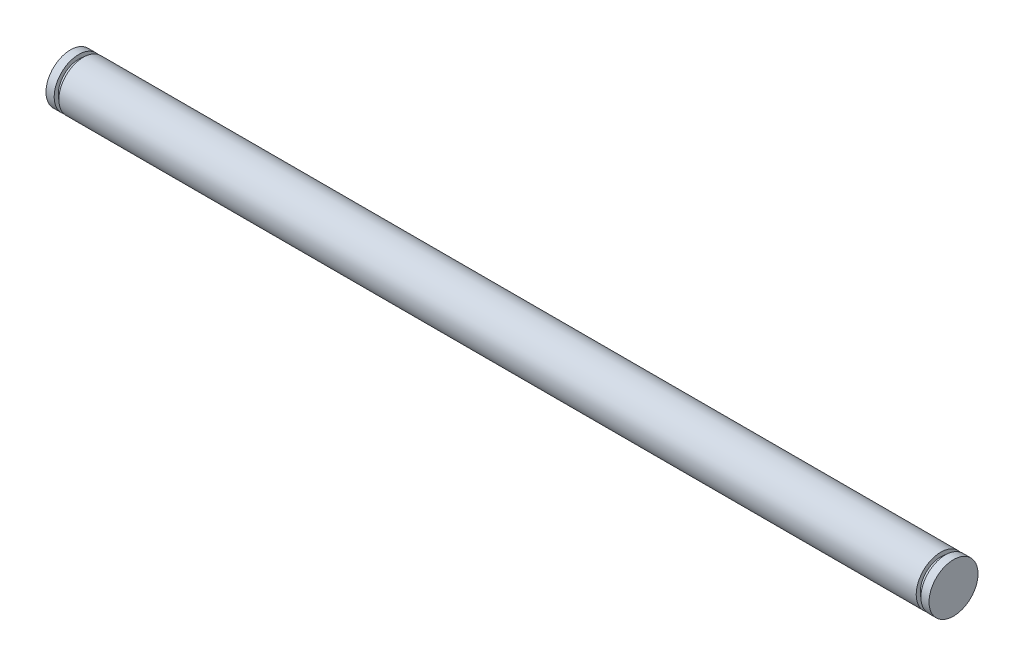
from build123d import *

# Parameters (mm, degrees)
SKETCH_2_R          = 6
EXTRUDE_1_DEPTH     = 216.3
CUT_EXTRUDE_START   = 2
SKETCH_3_OUTSIDE_W  = 57.392
SKETCH_3_OUTSIDE_H  = 57.392
SKETCH_3_OUTSIDE_R  = 5
CUT_EXTRUDE_1_DEPTH = 1.15
CUT_EXTRUDE_START_2 = -2
SKETCH_4_OUTSIDE_W  = 57.392
SKETCH_4_OUTSIDE_H  = 57.392
SKETCH_4_OUTSIDE_R  = 5
CUT_EXTRUDE_2_DEPTH = 1.15


with BuildPart() as part:
    # Sketch 2 → Extrude 1 (new body)
    with BuildSketch(Plane(origin=(0, 0, 0), x_dir=(0, 0, -1), z_dir=(1, 0, 0))):
        with Locations(Location((0, 0, 0), (0, 0, 180))):
            Circle(SKETCH_2_R)
    extrude(amount=EXTRUDE_1_DEPTH)

    # Sketch 3 outside → Cut-Extrude 1 (cut)
    with BuildSketch(Plane(origin=(0, 0, 0), x_dir=(0, 0, -1), z_dir=(1, 0, 0)).offset(CUT_EXTRUDE_START)):
        Rectangle(SKETCH_3_OUTSIDE_W, SKETCH_3_OUTSIDE_H)
        Circle(SKETCH_3_OUTSIDE_R, mode=Mode.SUBTRACT)
    extrude(amount=CUT_EXTRUDE_1_DEPTH, mode=Mode.SUBTRACT)

    # Sketch 4 outside → Cut-Extrude 2 (cut)
    with BuildSketch(Plane(origin=(216.3, 0, 0), x_dir=(0, 0, -1), z_dir=(1, 0, 0)).offset(CUT_EXTRUDE_START_2)):
        Rectangle(SKETCH_4_OUTSIDE_W, SKETCH_4_OUTSIDE_H)
        Circle(SKETCH_4_OUTSIDE_R, mode=Mode.SUBTRACT)
    extrude(amount=-CUT_EXTRUDE_2_DEPTH, mode=Mode.SUBTRACT)


solid = part.part
